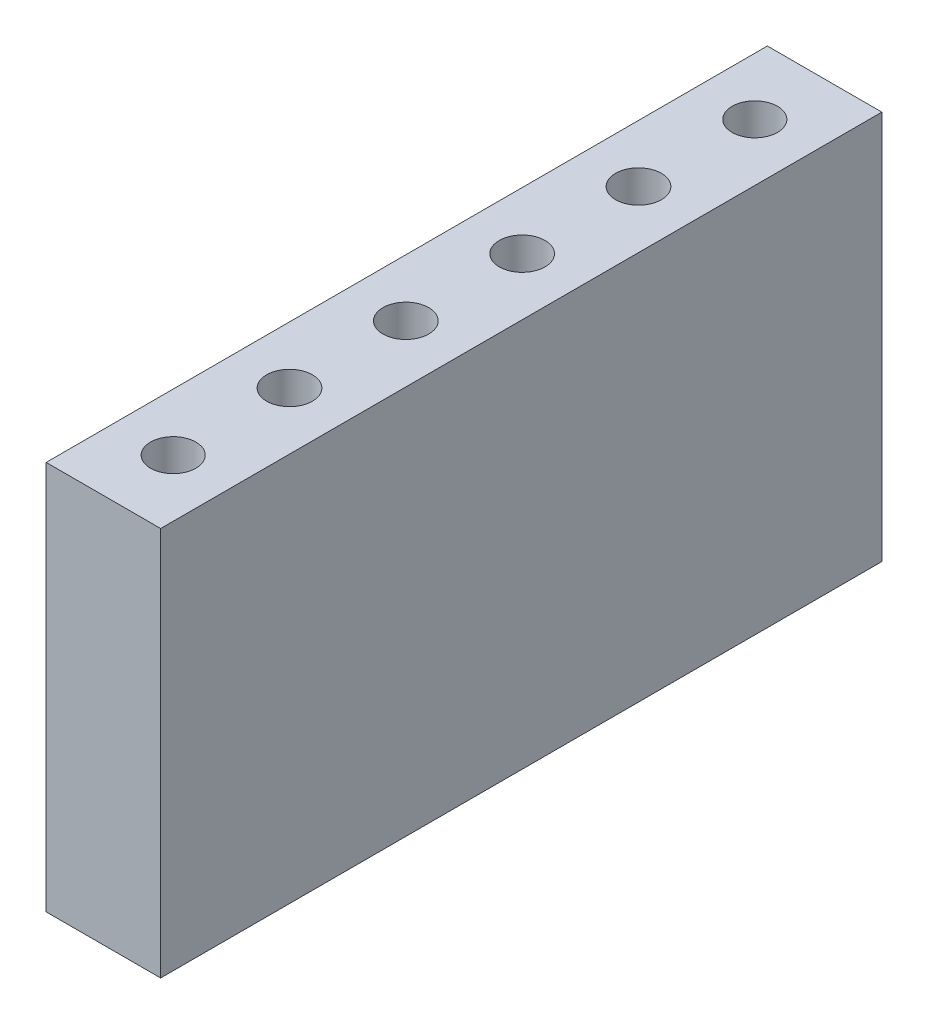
from build123d import *

# Parameters (mm, degrees)
SKETCH1_W          = 2.5
SKETCH1_H          = 15.748
EXTRUDE1_DEPTH     = 8.5
SKETCH2_R          = 0.5
SKETCH2_R_2        = 0.4953
CUT_EXTRUDE1_DEPTH = 6.38


with BuildPart() as part:
    # Sketch1 → Extrude1 (new body)
    with BuildSketch(Plane(origin=(0, 0, 0), x_dir=(1, 0, 0), z_dir=(0, 1, 0))):
        with Locations((1.25, 7.874)):
            Rectangle(SKETCH1_W, SKETCH1_H)
    extrude(amount=EXTRUDE1_DEPTH)

    # Sketch2 → Cut-Extrude1 (cut)
    with BuildSketch(Plane(origin=(0, 8.5, 0), x_dir=(-1, 0, 0), z_dir=(0, 1, 0))):
        with Locations(Location((-1.25, -6.604, 0), (0, 0, 90))):
            Circle(SKETCH2_R)
        with Locations(Location((-1.25, -4.064, 0), (0, 0, 90))):
            Circle(SKETCH2_R)
        with Locations(Location((-1.25, -1.524, 0), (0, 0, 90))):
            Circle(SKETCH2_R_2)
        with Locations(Location((-1.25, -14.224, 0), (0, 0, 270))):
            Circle(SKETCH2_R_2)
        with Locations(Location((-1.25, -11.684, 0), (0, 0, 270))):
            Circle(SKETCH2_R)
        with Locations(Location((-1.25, -9.144, 0), (0, 0, 270))):
            Circle(SKETCH2_R)
    extrude(amount=-CUT_EXTRUDE1_DEPTH, mode=Mode.SUBTRACT)


solid = part.part
